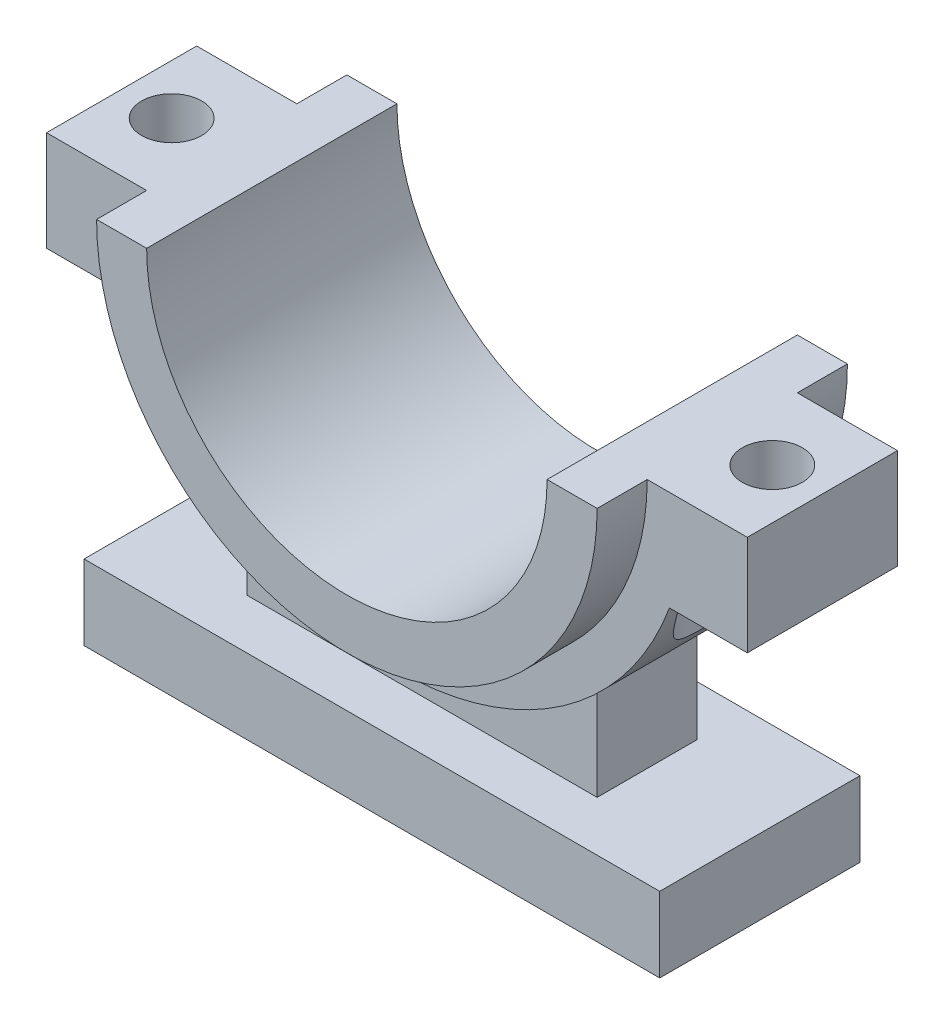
ISO-10303-21;
HEADER;
FILE_DESCRIPTION(('STEP AP214'),'2;1');
FILE_NAME('part.step','',(''),(''),'','','');
FILE_SCHEMA(('AUTOMOTIVE_DESIGN { 1 0 10303 214 1 1 1 1 }'));
ENDSEC;
DATA;
#1=APPLICATION_CONTEXT('core data for automotive mechanical design processes');
#2=APPLICATION_PROTOCOL_DEFINITION('international standard','automotive_design',2000,#1);
#3=PRODUCT_CONTEXT('',#1,'mechanical');
#4=PRODUCT('Part','Part','',(#3));
#5=PRODUCT_RELATED_PRODUCT_CATEGORY('part','',(#4));
#6=PRODUCT_DEFINITION_FORMATION('','',#4);
#7=PRODUCT_DEFINITION_CONTEXT('part definition',#1,'design');
#8=PRODUCT_DEFINITION('design','',#6,#7);
#9=PRODUCT_DEFINITION_SHAPE('','',#8);
#10=(LENGTH_UNIT() NAMED_UNIT(*) SI_UNIT(.MILLI.,.METRE.));
#11=(NAMED_UNIT(*) PLANE_ANGLE_UNIT() SI_UNIT($,.RADIAN.));
#12=(NAMED_UNIT(*) SI_UNIT($,.STERADIAN.) SOLID_ANGLE_UNIT());
#13=UNCERTAINTY_MEASURE_WITH_UNIT(LENGTH_MEASURE(1.E-05),#10,'distance_accuracy_value','');
#14=(GEOMETRIC_REPRESENTATION_CONTEXT(3) GLOBAL_UNCERTAINTY_ASSIGNED_CONTEXT((#13)) GLOBAL_UNIT_ASSIGNED_CONTEXT((#10,
#11,#12)) REPRESENTATION_CONTEXT('',''));
#15=CARTESIAN_POINT('',(0.,0.,0.));
#16=DIRECTION('',(0.,0.,1.));
#17=DIRECTION('',(1.,0.,0.));
#18=AXIS2_PLACEMENT_3D('',#15,#16,#17);
#19=CARTESIAN_POINT('',(0.,0.,15.));
#20=DIRECTION('',(0.,0.,-1.));
#21=DIRECTION('',(-1.,0.,0.));
#22=AXIS2_PLACEMENT_3D('',#19,#20,#21);
#23=CYLINDRICAL_SURFACE('',#22,58.);
#24=DIRECTION('',(0.,0.,-1.));
#25=VECTOR('',#24,1.);
#26=CARTESIAN_POINT('',(-35.,-46.2493243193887,10.));
#27=LINE('',#26,#25);
#28=CARTESIAN_POINT('',(-35.,-46.2493243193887,10.));
#29=VERTEX_POINT('',#28);
#30=CARTESIAN_POINT('',(-35.,-46.2493243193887,-10.));
#31=VERTEX_POINT('',#30);
#32=EDGE_CURVE('E60',#29,#31,#27,.T.);
#33=ORIENTED_EDGE('',*,*,#32,.F.);
#34=CARTESIAN_POINT('',(0.,0.,10.));
#35=DIRECTION('',(0.,0.,1.));
#36=DIRECTION('',(1.,0.,0.));
#37=AXIS2_PLACEMENT_3D('',#34,#35,#36);
#38=CIRCLE('',#37,58.);
#39=CARTESIAN_POINT('',(35.,-46.2493243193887,10.));
#40=VERTEX_POINT('',#39);
#41=EDGE_CURVE('E55',#29,#40,#38,.T.);
#42=ORIENTED_EDGE('',*,*,#41,.T.);
#43=DIRECTION('',(0.,0.,-1.));
#44=VECTOR('',#43,1.);
#45=CARTESIAN_POINT('',(35.,-46.2493243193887,10.));
#46=LINE('',#45,#44);
#47=CARTESIAN_POINT('',(35.,-46.2493243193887,-10.));
#48=VERTEX_POINT('',#47);
#49=EDGE_CURVE('E252',#40,#48,#46,.T.);
#50=ORIENTED_EDGE('',*,*,#49,.T.);
#51=CARTESIAN_POINT('',(0.,0.,-10.));
#52=DIRECTION('',(0.,0.,1.));
#53=DIRECTION('',(1.,0.,0.));
#54=AXIS2_PLACEMENT_3D('',#51,#52,#53);
#55=CIRCLE('',#54,58.);
#56=EDGE_CURVE('E244',#31,#48,#55,.T.);
#57=ORIENTED_EDGE('',*,*,#56,.F.);
#58=EDGE_LOOP('',(#33,#42,#50,#57));
#59=FACE_BOUND('',#58,.T.);
#60=CARTESIAN_POINT('',(-54.4426303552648,-20.,-12.8497331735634));
#61=CARTESIAN_POINT('',(-54.2826467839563,-20.4355339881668,-12.7805017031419));
#62=CARTESIAN_POINT('',(-54.1176847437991,-20.8683993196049,-12.7056478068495));
#63=CARTESIAN_POINT('',(-53.7782681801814,-21.7281186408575,-12.5429569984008));
#64=CARTESIAN_POINT('',(-53.6038099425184,-22.1549701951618,-12.4551149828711));
#65=CARTESIAN_POINT('',(-53.2446160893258,-23.0048999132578,-12.2640294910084));
#66=CARTESIAN_POINT('',(-53.0598117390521,-23.4279237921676,-12.1606727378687));
#67=CARTESIAN_POINT('',(-52.6819381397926,-24.2657061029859,-11.9370927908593));
#68=CARTESIAN_POINT('',(-52.4888698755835,-24.6804655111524,-11.8168716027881));
#69=CARTESIAN_POINT('',(-52.0916321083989,-25.5083647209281,-11.554887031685));
#70=CARTESIAN_POINT('',(-51.8873205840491,-25.9213202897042,-11.4127541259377));
#71=CARTESIAN_POINT('',(-51.4723985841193,-26.7357633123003,-11.1061502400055));
#72=CARTESIAN_POINT('',(-51.2617871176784,-27.1372489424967,-10.9416757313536));
#73=CARTESIAN_POINT('',(-50.836767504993,-27.925307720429,-10.5882628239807));
#74=CARTESIAN_POINT('',(-50.6223743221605,-28.3119260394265,-10.3994076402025));
#75=CARTESIAN_POINT('',(-50.191466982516,-29.0689889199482,-9.99400586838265));
#76=CARTESIAN_POINT('',(-49.9749538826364,-29.439441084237,-9.77747248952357));
#77=CARTESIAN_POINT('',(-49.60349810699,-30.0596830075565,-9.37894550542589));
#78=CARTESIAN_POINT('',(-49.4483569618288,-30.3141178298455,-9.2043536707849));
#79=CARTESIAN_POINT('',(-49.1398326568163,-30.8117266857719,-8.83821754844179));
#80=CARTESIAN_POINT('',(-48.9864497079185,-31.0548993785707,-8.64667125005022));
#81=CARTESIAN_POINT('',(-48.6835324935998,-31.5276427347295,-8.24623571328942));
#82=CARTESIAN_POINT('',(-48.533988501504,-31.7572502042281,-8.03739748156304));
#83=CARTESIAN_POINT('',(-48.2402128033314,-32.2017519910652,-7.6010894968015));
#84=CARTESIAN_POINT('',(-48.0959809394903,-32.416646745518,-7.37362029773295));
#85=CARTESIAN_POINT('',(-47.81318875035,-32.8323469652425,-6.8963449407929));
#86=CARTESIAN_POINT('',(-47.6747285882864,-33.0329286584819,-6.64628328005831));
#87=CARTESIAN_POINT('',(-47.4082039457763,-33.4143131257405,-6.12633387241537));
#88=CARTESIAN_POINT('',(-47.2801369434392,-33.5951207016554,-5.85645096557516));
#89=CARTESIAN_POINT('',(-47.0374049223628,-33.9341418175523,-5.29753237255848));
#90=CARTESIAN_POINT('',(-46.9227258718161,-34.0923790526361,-5.00851724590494));
#91=CARTESIAN_POINT('',(-46.7097275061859,-34.3836289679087,-4.41233649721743));
#92=CARTESIAN_POINT('',(-46.6114011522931,-34.5166525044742,-4.1051787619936));
#93=CARTESIAN_POINT('',(-46.4589952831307,-34.7213647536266,-3.56325142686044));
#94=CARTESIAN_POINT('',(-46.4002381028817,-34.799794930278,-3.33231881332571));
#95=CARTESIAN_POINT('',(-46.293824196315,-34.9412318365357,-2.86330595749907));
#96=CARTESIAN_POINT('',(-46.2461647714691,-35.004242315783,-2.62522746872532));
#97=CARTESIAN_POINT('',(-46.1628881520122,-35.1139931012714,-2.14338233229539));
#98=CARTESIAN_POINT('',(-46.1272657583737,-35.1607404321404,-1.89961818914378));
#99=CARTESIAN_POINT('',(-46.0687740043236,-35.2373437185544,-1.40791792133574));
#100=CARTESIAN_POINT('',(-46.0459050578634,-35.2671991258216,-1.15998166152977));
#101=CARTESIAN_POINT('',(-46.0133746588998,-35.3096314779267,-0.661048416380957));
#102=CARTESIAN_POINT('',(-46.0037512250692,-35.322158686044,-0.410044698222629));
#103=CARTESIAN_POINT('',(-45.9980508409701,-35.3295816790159,0.092377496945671));
#104=CARTESIAN_POINT('',(-46.0019738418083,-35.3244775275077,0.343795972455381));
#105=CARTESIAN_POINT('',(-46.0232779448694,-35.2967164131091,0.845095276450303));
#106=CARTESIAN_POINT('',(-46.0406597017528,-35.2740585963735,1.09497602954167));
#107=CARTESIAN_POINT('',(-46.0884965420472,-35.2115326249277,1.5912980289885));
#108=CARTESIAN_POINT('',(-46.1189515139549,-35.1716646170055,1.83773930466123));
#109=CARTESIAN_POINT('',(-46.1908328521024,-35.077205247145,2.315819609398));
#110=CARTESIAN_POINT('',(-46.2317788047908,-35.0232570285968,2.54765898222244));
#111=CARTESIAN_POINT('',(-46.324359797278,-34.9007103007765,3.00522059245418));
#112=CARTESIAN_POINT('',(-46.3759942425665,-34.8321126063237,3.23094316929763));
#113=CARTESIAN_POINT('',(-46.4890663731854,-34.6810553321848,3.67521818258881));
#114=CARTESIAN_POINT('',(-46.5505061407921,-34.5985928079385,3.89376908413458));
#115=CARTESIAN_POINT('',(-46.6822018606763,-34.4206955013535,4.32280435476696));
#116=CARTESIAN_POINT('',(-46.7524596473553,-34.3252580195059,4.53328703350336));
#117=CARTESIAN_POINT('',(-46.9281261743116,-34.0849018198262,5.02155161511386));
#118=CARTESIAN_POINT('',(-47.0369434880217,-33.9347140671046,5.29552977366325));
#119=CARTESIAN_POINT('',(-47.2665667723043,-33.6141419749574,5.82608949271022));
#120=CARTESIAN_POINT('',(-47.3873763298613,-33.4437515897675,6.0826658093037));
#121=CARTESIAN_POINT('',(-47.6385784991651,-33.0849482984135,6.57818202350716));
#122=CARTESIAN_POINT('',(-47.7689782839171,-32.89652186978,6.81710844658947));
#123=CARTESIAN_POINT('',(-48.0370377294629,-32.5038397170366,7.27725705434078));
#124=CARTESIAN_POINT('',(-48.1746995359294,-32.2995793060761,7.49847395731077));
#125=CARTESIAN_POINT('',(-48.5178925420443,-31.7828306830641,8.01853893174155));
#126=CARTESIAN_POINT('',(-48.7262886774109,-31.4627327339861,8.30795969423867));
#127=CARTESIAN_POINT('',(-49.1489088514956,-30.798376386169,8.85284202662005));
#128=CARTESIAN_POINT('',(-49.3631356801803,-30.4541062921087,9.10828698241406));
#129=CARTESIAN_POINT('',(-49.7944975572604,-29.7435994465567,9.58919281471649));
#130=CARTESIAN_POINT('',(-50.0116421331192,-29.3772518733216,9.81448029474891));
#131=CARTESIAN_POINT('',(-50.4444289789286,-28.6277287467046,10.2363262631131));
#132=CARTESIAN_POINT('',(-50.6600714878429,-28.2445559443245,10.4328894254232));
#133=CARTESIAN_POINT('',(-51.0407332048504,-27.5493119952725,10.7601109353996));
#134=CARTESIAN_POINT('',(-51.2065200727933,-27.2399948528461,10.8957859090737));
#135=CARTESIAN_POINT('',(-51.5348057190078,-26.6136955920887,11.1527551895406));
#136=CARTESIAN_POINT('',(-51.6973041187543,-26.2967126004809,11.2740478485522));
#137=CARTESIAN_POINT('',(-52.0183942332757,-25.6557071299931,11.5036061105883));
#138=CARTESIAN_POINT('',(-52.1769818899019,-25.3316779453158,11.6118585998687));
#139=CARTESIAN_POINT('',(-52.4894812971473,-24.6776360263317,11.8163860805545));
#140=CARTESIAN_POINT('',(-52.6433928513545,-24.3476230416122,11.9126605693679));
#141=CARTESIAN_POINT('',(-52.9430663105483,-23.6888182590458,12.092544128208));
#142=CARTESIAN_POINT('',(-53.0889289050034,-23.3601297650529,12.1763648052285));
#143=CARTESIAN_POINT('',(-53.3753081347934,-22.698161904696,12.3345128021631));
#144=CARTESIAN_POINT('',(-53.5158245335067,-22.3648823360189,12.4088397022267));
#145=CARTESIAN_POINT('',(-53.7908324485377,-21.6950923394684,12.5487051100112));
#146=CARTESIAN_POINT('',(-53.9253388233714,-21.3585926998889,12.6142661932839));
#147=CARTESIAN_POINT('',(-54.1884579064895,-20.6819467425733,12.7376207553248));
#148=CARTESIAN_POINT('',(-54.3170715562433,-20.341801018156,12.7954154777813));
#149=CARTESIAN_POINT('',(-54.4426303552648,-20.,12.8497331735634));
#150=B_SPLINE_CURVE_WITH_KNOTS('',3,(#60,#61,#62,#63,#64,#65,#66,#67,#68,#69,#70,#71,#72,#73,
#74,#75,#76,#77,#78,#79,#80,#81,#82,#83,#84,#85,#86,#87,#88,#89,#90,#91,#92,#93,#94,#95,#96,#97,
#98,#99,#100,#101,#102,#103,#104,#105,#106,#107,#108,#109,#110,#111,#112,#113,#114,#115,#116,
#117,#118,#119,#120,#121,#122,#123,#124,#125,#126,#127,#128,#129,#130,#131,#132,#133,#134,#135,
#136,#137,#138,#139,#140,#141,#142,#143,#144,#145,#146,#147,#148,#149),.UNSPECIFIED.,.F.,.F.,(4,
2,2,2,2,2,2,2,2,2,2,2,2,2,2,2,2,2,2,2,2,2,2,2,2,2,2,2,2,2,2,2,2,2,2,2,2,2,2,2,2,2,2,2,4),(0.,
1.40737975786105,2.81531398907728,4.23407866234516,5.65267473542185,7.0985272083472,
8.54460829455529,9.9858780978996,11.4264626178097,12.4620816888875,13.4978237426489,
14.5306126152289,15.5633707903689,16.609779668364,17.655933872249,18.7009815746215,
19.7455782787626,20.4974312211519,21.2491011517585,22.0004460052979,22.7518152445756,
23.5053366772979,24.2588553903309,25.0124107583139,25.7659596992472,26.4897701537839,
27.213540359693,27.9374644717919,28.66153943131,29.6526139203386,30.6439857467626,
31.6361067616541,32.6285225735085,34.0639471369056,35.5000710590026,36.944126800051,
38.3879473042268,39.5163502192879,40.6448822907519,41.7745399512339,42.904244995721,
44.0117633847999,45.1193307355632,46.223988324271,47.3284688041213),.UNSPECIFIED.);
#151=CARTESIAN_POINT('',(-54.4426303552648,-20.,-12.8497331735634));
#152=VERTEX_POINT('',#151);
#153=CARTESIAN_POINT('',(-54.4426303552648,-20.,12.8497331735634));
#154=VERTEX_POINT('',#153);
#155=EDGE_CURVE('E11',#152,#154,#150,.T.);
#156=ORIENTED_EDGE('',*,*,#155,.F.);
#157=DIRECTION('',(0.,0.,-1.));
#158=VECTOR('',#157,1.);
#159=CARTESIAN_POINT('',(-54.4426303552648,-20.,15.));
#160=LINE('',#159,#158);
#161=CARTESIAN_POINT('',(-54.4426303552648,-20.,-15.));
#162=VERTEX_POINT('',#161);
#163=EDGE_CURVE('E343',#152,#162,#160,.T.);
#164=ORIENTED_EDGE('',*,*,#163,.T.);
#165=CARTESIAN_POINT('',(0.,0.,-15.));
#166=DIRECTION('',(0.,0.,1.));
#167=DIRECTION('',(1.,0.,0.));
#168=AXIS2_PLACEMENT_3D('',#165,#166,#167);
#169=CIRCLE('',#168,58.);
#170=CARTESIAN_POINT('',(54.4426303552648,-20.,-15.));
#171=VERTEX_POINT('',#170);
#172=EDGE_CURVE('E376',#162,#171,#169,.T.);
#173=ORIENTED_EDGE('',*,*,#172,.T.);
#174=DIRECTION('',(0.,0.,-1.));
#175=VECTOR('',#174,1.);
#176=CARTESIAN_POINT('',(54.4426303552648,-20.,15.));
#177=LINE('',#176,#175);
#178=CARTESIAN_POINT('',(54.4426303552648,-20.,-12.8497331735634));
#179=VERTEX_POINT('',#178);
#180=EDGE_CURVE('E357',#179,#171,#177,.T.);
#181=ORIENTED_EDGE('',*,*,#180,.F.);
#182=CARTESIAN_POINT('',(54.4426303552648,-20.,12.8497331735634));
#183=CARTESIAN_POINT('',(54.2826467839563,-20.4355339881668,12.7805017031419));
#184=CARTESIAN_POINT('',(54.1176847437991,-20.8683993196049,12.7056478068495));
#185=CARTESIAN_POINT('',(53.7782681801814,-21.7281186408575,12.5429569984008));
#186=CARTESIAN_POINT('',(53.6038099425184,-22.1549701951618,12.4551149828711));
#187=CARTESIAN_POINT('',(53.2446160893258,-23.0048999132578,12.2640294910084));
#188=CARTESIAN_POINT('',(53.0598117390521,-23.4279237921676,12.1606727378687));
#189=CARTESIAN_POINT('',(52.6819381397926,-24.2657061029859,11.9370927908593));
#190=CARTESIAN_POINT('',(52.4888698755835,-24.6804655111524,11.8168716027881));
#191=CARTESIAN_POINT('',(52.0916321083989,-25.5083647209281,11.554887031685));
#192=CARTESIAN_POINT('',(51.8873205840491,-25.9213202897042,11.4127541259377));
#193=CARTESIAN_POINT('',(51.4723985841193,-26.7357633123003,11.1061502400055));
#194=CARTESIAN_POINT('',(51.2617871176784,-27.1372489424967,10.9416757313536));
#195=CARTESIAN_POINT('',(50.836767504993,-27.9253077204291,10.5882628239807));
#196=CARTESIAN_POINT('',(50.6223743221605,-28.3119260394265,10.3994076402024));
#197=CARTESIAN_POINT('',(50.191466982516,-29.0689889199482,9.99400586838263));
#198=CARTESIAN_POINT('',(49.9749538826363,-29.439441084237,9.77747248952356));
#199=CARTESIAN_POINT('',(49.60349810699,-30.0596830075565,9.37894550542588));
#200=CARTESIAN_POINT('',(49.4483569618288,-30.3141178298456,9.20435367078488));
#201=CARTESIAN_POINT('',(49.1398326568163,-30.8117266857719,8.83821754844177));
#202=CARTESIAN_POINT('',(48.9864497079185,-31.0548993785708,8.6466712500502));
#203=CARTESIAN_POINT('',(48.6835324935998,-31.5276427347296,8.2462357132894));
#204=CARTESIAN_POINT('',(48.533988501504,-31.7572502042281,8.03739748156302));
#205=CARTESIAN_POINT('',(48.2402128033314,-32.2017519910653,7.60108949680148));
#206=CARTESIAN_POINT('',(48.0959809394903,-32.416646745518,7.37362029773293));
#207=CARTESIAN_POINT('',(47.81318875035,-32.8323469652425,6.89634494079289));
#208=CARTESIAN_POINT('',(47.6747285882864,-33.0329286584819,6.64628328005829));
#209=CARTESIAN_POINT('',(47.4082039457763,-33.4143131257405,6.12633387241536));
#210=CARTESIAN_POINT('',(47.2801369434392,-33.5951207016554,5.85645096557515));
#211=CARTESIAN_POINT('',(47.0374049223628,-33.9341418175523,5.29753237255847));
#212=CARTESIAN_POINT('',(46.9227258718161,-34.0923790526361,5.00851724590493));
#213=CARTESIAN_POINT('',(46.7097275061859,-34.3836289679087,4.41233649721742));
#214=CARTESIAN_POINT('',(46.6114011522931,-34.5166525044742,4.10517876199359));
#215=CARTESIAN_POINT('',(46.4589952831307,-34.7213647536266,3.56325142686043));
#216=CARTESIAN_POINT('',(46.4002381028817,-34.799794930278,3.3323188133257));
#217=CARTESIAN_POINT('',(46.293824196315,-34.9412318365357,2.86330595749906));
#218=CARTESIAN_POINT('',(46.2461647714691,-35.004242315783,2.62522746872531));
#219=CARTESIAN_POINT('',(46.1628881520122,-35.1139931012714,2.14338233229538));
#220=CARTESIAN_POINT('',(46.1272657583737,-35.1607404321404,1.89961818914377));
#221=CARTESIAN_POINT('',(46.0687740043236,-35.2373437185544,1.40791792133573));
#222=CARTESIAN_POINT('',(46.0459050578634,-35.2671991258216,1.15998166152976));
#223=CARTESIAN_POINT('',(46.0133746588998,-35.3096314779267,0.661048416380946));
#224=CARTESIAN_POINT('',(46.0037512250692,-35.3221586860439,0.410044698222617));
#225=CARTESIAN_POINT('',(45.9980508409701,-35.3295816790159,-0.092377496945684));
#226=CARTESIAN_POINT('',(46.0019738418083,-35.3244775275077,-0.343795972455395));
#227=CARTESIAN_POINT('',(46.0232779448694,-35.2967164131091,-0.845095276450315));
#228=CARTESIAN_POINT('',(46.0406597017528,-35.2740585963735,-1.09497602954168));
#229=CARTESIAN_POINT('',(46.0884965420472,-35.2115326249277,-1.59129802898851));
#230=CARTESIAN_POINT('',(46.1189515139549,-35.1716646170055,-1.83773930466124));
#231=CARTESIAN_POINT('',(46.1908328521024,-35.077205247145,-2.31581960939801));
#232=CARTESIAN_POINT('',(46.2317788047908,-35.0232570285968,-2.54765898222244));
#233=CARTESIAN_POINT('',(46.324359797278,-34.9007103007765,-3.00522059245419));
#234=CARTESIAN_POINT('',(46.3759942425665,-34.8321126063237,-3.23094316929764));
#235=CARTESIAN_POINT('',(46.4890663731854,-34.6810553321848,-3.67521818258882));
#236=CARTESIAN_POINT('',(46.5505061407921,-34.5985928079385,-3.89376908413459));
#237=CARTESIAN_POINT('',(46.6822018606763,-34.4206955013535,-4.32280435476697));
#238=CARTESIAN_POINT('',(46.7524596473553,-34.3252580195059,-4.53328703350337));
#239=CARTESIAN_POINT('',(46.9281261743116,-34.0849018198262,-5.02155161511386));
#240=CARTESIAN_POINT('',(47.0369434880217,-33.9347140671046,-5.29552977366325));
#241=CARTESIAN_POINT('',(47.2665667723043,-33.6141419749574,-5.82608949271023));
#242=CARTESIAN_POINT('',(47.3873763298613,-33.4437515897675,-6.08266580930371));
#243=CARTESIAN_POINT('',(47.6385784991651,-33.0849482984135,-6.57818202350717));
#244=CARTESIAN_POINT('',(47.7689782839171,-32.89652186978,-6.81710844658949));
#245=CARTESIAN_POINT('',(48.0370377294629,-32.5038397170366,-7.27725705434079));
#246=CARTESIAN_POINT('',(48.1746995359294,-32.2995793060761,-7.49847395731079));
#247=CARTESIAN_POINT('',(48.5178925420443,-31.782830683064,-8.01853893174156));
#248=CARTESIAN_POINT('',(48.7262886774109,-31.4627327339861,-8.30795969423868));
#249=CARTESIAN_POINT('',(49.1489088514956,-30.798376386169,-8.85284202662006));
#250=CARTESIAN_POINT('',(49.3631356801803,-30.4541062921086,-9.10828698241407));
#251=CARTESIAN_POINT('',(49.7944975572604,-29.7435994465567,-9.58919281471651));
#252=CARTESIAN_POINT('',(50.0116421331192,-29.3772518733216,-9.81448029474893));
#253=CARTESIAN_POINT('',(50.4444289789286,-28.6277287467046,-10.2363262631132));
#254=CARTESIAN_POINT('',(50.6600714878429,-28.2445559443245,-10.4328894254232));
#255=CARTESIAN_POINT('',(51.0407332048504,-27.5493119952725,-10.7601109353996));
#256=CARTESIAN_POINT('',(51.2065200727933,-27.2399948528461,-10.8957859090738));
#257=CARTESIAN_POINT('',(51.5348057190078,-26.6136955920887,-11.1527551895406));
#258=CARTESIAN_POINT('',(51.6973041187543,-26.2967126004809,-11.2740478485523));
#259=CARTESIAN_POINT('',(52.0183942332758,-25.6557071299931,-11.5036061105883));
#260=CARTESIAN_POINT('',(52.1769818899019,-25.3316779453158,-11.6118585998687));
#261=CARTESIAN_POINT('',(52.4894812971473,-24.6776360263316,-11.8163860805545));
#262=CARTESIAN_POINT('',(52.6433928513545,-24.3476230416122,-11.912660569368));
#263=CARTESIAN_POINT('',(52.9430663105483,-23.6888182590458,-12.092544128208));
#264=CARTESIAN_POINT('',(53.0889289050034,-23.3601297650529,-12.1763648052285));
#265=CARTESIAN_POINT('',(53.3753081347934,-22.698161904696,-12.3345128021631));
#266=CARTESIAN_POINT('',(53.5158245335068,-22.3648823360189,-12.4088397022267));
#267=CARTESIAN_POINT('',(53.7908324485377,-21.6950923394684,-12.5487051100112));
#268=CARTESIAN_POINT('',(53.9253388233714,-21.3585926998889,-12.6142661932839));
#269=CARTESIAN_POINT('',(54.1884579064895,-20.6819467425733,-12.7376207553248));
#270=CARTESIAN_POINT('',(54.3170715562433,-20.341801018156,-12.7954154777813));
#271=CARTESIAN_POINT('',(54.4426303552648,-20.,-12.8497331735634));
#272=B_SPLINE_CURVE_WITH_KNOTS('',3,(#182,#183,#184,#185,#186,#187,#188,#189,#190,#191,#192,
#193,#194,#195,#196,#197,#198,#199,#200,#201,#202,#203,#204,#205,#206,#207,#208,#209,#210,#211,
#212,#213,#214,#215,#216,#217,#218,#219,#220,#221,#222,#223,#224,#225,#226,#227,#228,#229,#230,
#231,#232,#233,#234,#235,#236,#237,#238,#239,#240,#241,#242,#243,#244,#245,#246,#247,#248,#249,
#250,#251,#252,#253,#254,#255,#256,#257,#258,#259,#260,#261,#262,#263,#264,#265,#266,#267,#268,
#269,#270,#271),.UNSPECIFIED.,.F.,.F.,(4,2,2,2,2,2,2,2,2,2,2,2,2,2,2,2,2,2,2,2,2,2,2,2,2,2,2,2,
2,2,2,2,2,2,2,2,2,2,2,2,2,2,2,2,4),(0.,1.40737975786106,2.81531398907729,4.23407866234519,
5.65267473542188,7.09852720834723,8.54460829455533,9.98587809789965,11.4264626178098,
12.4620816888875,13.4978237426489,14.5306126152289,15.5633707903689,16.609779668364,
17.655933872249,18.7009815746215,19.7455782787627,20.4974312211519,21.2491011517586,
22.0004460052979,22.7518152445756,23.5053366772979,24.2588553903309,25.0124107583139,
25.7659596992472,26.4897701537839,27.213540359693,27.937464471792,28.66153943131,
29.6526139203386,30.6439857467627,31.6361067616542,32.6285225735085,34.0639471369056,
35.5000710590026,36.944126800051,38.3879473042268,39.5163502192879,40.6448822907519,
41.7745399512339,42.904244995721,44.0117633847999,45.1193307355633,46.223988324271,
47.3284688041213),.UNSPECIFIED.);
#273=CARTESIAN_POINT('',(54.4426303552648,-20.,12.8497331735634));
#274=VERTEX_POINT('',#273);
#275=EDGE_CURVE('E260',#274,#179,#272,.T.);
#276=ORIENTED_EDGE('',*,*,#275,.F.);
#277=CARTESIAN_POINT('',(54.4426303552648,-20.,15.));
#278=VERTEX_POINT('',#277);
#279=EDGE_CURVE('E353',#278,#274,#177,.T.);
#280=ORIENTED_EDGE('',*,*,#279,.F.);
#281=CARTESIAN_POINT('',(0.,0.,15.));
#282=DIRECTION('',(0.,0.,1.));
#283=DIRECTION('',(1.,0.,0.));
#284=AXIS2_PLACEMENT_3D('',#281,#282,#283);
#285=CIRCLE('',#284,58.);
#286=CARTESIAN_POINT('',(-54.4426303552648,-20.,15.));
#287=VERTEX_POINT('',#286);
#288=EDGE_CURVE('E431',#287,#278,#285,.T.);
#289=ORIENTED_EDGE('',*,*,#288,.F.);
#290=EDGE_CURVE('E347',#287,#154,#160,.T.);
#291=ORIENTED_EDGE('',*,*,#290,.T.);
#292=EDGE_LOOP('',(#156,#164,#173,#181,#276,#280,#289,#291));
#293=FACE_BOUND('',#292,.T.);
#294=ADVANCED_FACE('F35',(#59,#293),#23,.T.);
#295=CARTESIAN_POINT('',(0.,0.,15.));
#296=DIRECTION('',(0.,-1.,0.));
#297=DIRECTION('',(1.,0.,0.));
#298=AXIS2_PLACEMENT_3D('',#295,#296,#297);
#299=PLANE('',#298);
#300=CARTESIAN_POINT('',(-60.,0.,0.));
#301=DIRECTION('',(0.,-1.,0.));
#302=DIRECTION('',(0.,0.,-1.));
#303=AXIS2_PLACEMENT_3D('',#300,#301,#302);
#304=CIRCLE('',#303,6.);
#305=CARTESIAN_POINT('',(-60.,0.,-6.));
#306=VERTEX_POINT('',#305);
#307=EDGE_CURVE('E269',#306,#306,#304,.T.);
#308=ORIENTED_EDGE('',*,*,#307,.T.);
#309=EDGE_LOOP('',(#308));
#310=FACE_BOUND('',#309,.T.);
#311=DIRECTION('',(-1.,0.,0.));
#312=VECTOR('',#311,1.);
#313=CARTESIAN_POINT('',(0.,0.,-15.));
#314=LINE('',#313,#312);
#315=CARTESIAN_POINT('',(-50.,0.,-15.));
#316=VERTEX_POINT('',#315);
#317=CARTESIAN_POINT('',(-70.,0.,-15.));
#318=VERTEX_POINT('',#317);
#319=EDGE_CURVE('E374',#316,#318,#314,.T.);
#320=ORIENTED_EDGE('',*,*,#319,.T.);
#321=DIRECTION('',(0.,0.,-1.));
#322=VECTOR('',#321,1.);
#323=CARTESIAN_POINT('',(-70.,0.,15.));
#324=LINE('',#323,#322);
#325=CARTESIAN_POINT('',(-70.,0.,15.));
#326=VERTEX_POINT('',#325);
#327=EDGE_CURVE('E48',#326,#318,#324,.T.);
#328=ORIENTED_EDGE('',*,*,#327,.F.);
#329=DIRECTION('',(-1.,0.,0.));
#330=VECTOR('',#329,1.);
#331=CARTESIAN_POINT('',(0.,0.,15.));
#332=LINE('',#331,#330);
#333=CARTESIAN_POINT('',(-50.,0.,15.));
#334=VERTEX_POINT('',#333);
#335=EDGE_CURVE('E426',#334,#326,#332,.T.);
#336=ORIENTED_EDGE('',*,*,#335,.F.);
#337=DIRECTION('',(0.,0.,-1.));
#338=VECTOR('',#337,1.);
#339=CARTESIAN_POINT('',(-50.,0.,25.));
#340=LINE('',#339,#338);
#341=CARTESIAN_POINT('',(-50.,0.,25.));
#342=VERTEX_POINT('',#341);
#343=EDGE_CURVE('E418',#342,#334,#340,.T.);
#344=ORIENTED_EDGE('',*,*,#343,.F.);
#345=DIRECTION('',(-1.,0.,0.));
#346=VECTOR('',#345,1.);
#347=CARTESIAN_POINT('',(0.,0.,25.));
#348=LINE('',#347,#346);
#349=CARTESIAN_POINT('',(-40.,0.,25.));
#350=VERTEX_POINT('',#349);
#351=EDGE_CURVE('E436',#350,#342,#348,.T.);
#352=ORIENTED_EDGE('',*,*,#351,.F.);
#353=DIRECTION('',(0.,0.,-1.));
#354=VECTOR('',#353,1.);
#355=CARTESIAN_POINT('',(-40.,0.,25.));
#356=LINE('',#355,#354);
#357=CARTESIAN_POINT('',(-40.,0.,-25.));
#358=VERTEX_POINT('',#357);
#359=EDGE_CURVE('E439',#350,#358,#356,.T.);
#360=ORIENTED_EDGE('',*,*,#359,.T.);
#361=DIRECTION('',(-1.,0.,0.));
#362=VECTOR('',#361,1.);
#363=CARTESIAN_POINT('',(0.,0.,-25.));
#364=LINE('',#363,#362);
#365=CARTESIAN_POINT('',(-50.,0.,-25.));
#366=VERTEX_POINT('',#365);
#367=EDGE_CURVE('E454',#358,#366,#364,.T.);
#368=ORIENTED_EDGE('',*,*,#367,.T.);
#369=EDGE_CURVE('E419',#316,#366,#340,.T.);
#370=ORIENTED_EDGE('',*,*,#369,.F.);
#371=EDGE_LOOP('',(#320,#328,#336,#344,#352,#360,#368,#370));
#372=FACE_BOUND('',#371,.T.);
#373=ADVANCED_FACE('F37',(#310,#372),#299,.F.);
#374=CARTESIAN_POINT('',(-70.,0.,15.));
#375=DIRECTION('',(1.,0.,0.));
#376=DIRECTION('',(0.,0.,-1.));
#377=AXIS2_PLACEMENT_3D('',#374,#375,#376);
#378=PLANE('',#377);
#379=DIRECTION('',(0.,-1.,0.));
#380=VECTOR('',#379,1.);
#381=CARTESIAN_POINT('',(-70.,0.,-15.));
#382=LINE('',#381,#380);
#383=CARTESIAN_POINT('',(-70.,-20.,-15.));
#384=VERTEX_POINT('',#383);
#385=EDGE_CURVE('E368',#318,#384,#382,.T.);
#386=ORIENTED_EDGE('',*,*,#385,.T.);
#387=DIRECTION('',(0.,0.,-1.));
#388=VECTOR('',#387,1.);
#389=CARTESIAN_POINT('',(-70.,-20.,15.));
#390=LINE('',#389,#388);
#391=CARTESIAN_POINT('',(-70.,-20.,15.));
#392=VERTEX_POINT('',#391);
#393=EDGE_CURVE('E355',#392,#384,#390,.T.);
#394=ORIENTED_EDGE('',*,*,#393,.F.);
#395=DIRECTION('',(0.,-1.,0.));
#396=VECTOR('',#395,1.);
#397=CARTESIAN_POINT('',(-70.,0.,15.));
#398=LINE('',#397,#396);
#399=EDGE_CURVE('E369',#326,#392,#398,.T.);
#400=ORIENTED_EDGE('',*,*,#399,.F.);
#401=ORIENTED_EDGE('',*,*,#327,.T.);
#402=EDGE_LOOP('',(#386,#394,#400,#401));
#403=FACE_BOUND('',#402,.T.);
#404=ADVANCED_FACE('F330',(#403),#378,.F.);
#405=CARTESIAN_POINT('',(0.,-20.,15.));
#406=DIRECTION('',(0.,1.,0.));
#407=DIRECTION('',(0.,0.,1.));
#408=AXIS2_PLACEMENT_3D('',#405,#406,#407);
#409=PLANE('',#408);
#410=ORIENTED_EDGE('',*,*,#393,.T.);
#411=DIRECTION('',(1.,0.,0.));
#412=VECTOR('',#411,1.);
#413=CARTESIAN_POINT('',(0.,-20.,-15.));
#414=LINE('',#413,#412);
#415=EDGE_CURVE('E351',#384,#162,#414,.T.);
#416=ORIENTED_EDGE('',*,*,#415,.T.);
#417=ORIENTED_EDGE('',*,*,#163,.F.);
#418=CARTESIAN_POINT('',(-60.,-20.,0.));
#419=DIRECTION('',(0.,-1.,0.));
#420=DIRECTION('',(0.,0.,-1.));
#421=AXIS2_PLACEMENT_3D('',#418,#419,#420);
#422=CIRCLE('',#421,14.);
#423=EDGE_CURVE('E257',#152,#154,#422,.T.);
#424=ORIENTED_EDGE('',*,*,#423,.T.);
#425=ORIENTED_EDGE('',*,*,#290,.F.);
#426=DIRECTION('',(1.,0.,0.));
#427=VECTOR('',#426,1.);
#428=CARTESIAN_POINT('',(0.,-20.,15.));
#429=LINE('',#428,#427);
#430=EDGE_CURVE('E429',#392,#287,#429,.T.);
#431=ORIENTED_EDGE('',*,*,#430,.F.);
#432=EDGE_LOOP('',(#410,#416,#417,#424,#425,#431));
#433=FACE_BOUND('',#432,.T.);
#434=CARTESIAN_POINT('',(-60.,-20.,0.));
#435=DIRECTION('',(0.,-1.,0.));
#436=DIRECTION('',(0.,0.,-1.));
#437=AXIS2_PLACEMENT_3D('',#434,#435,#436);
#438=CIRCLE('',#437,6.);
#439=CARTESIAN_POINT('',(-60.,-20.,-6.));
#440=VERTEX_POINT('',#439);
#441=EDGE_CURVE('E697',#440,#440,#438,.T.);
#442=ORIENTED_EDGE('',*,*,#441,.F.);
#443=EDGE_LOOP('',(#442));
#444=FACE_BOUND('',#443,.T.);
#445=ADVANCED_FACE('F325',(#433,#444),#409,.F.);
#446=CARTESIAN_POINT('',(0.,-20.,15.));
#447=DIRECTION('',(0.,-1.,0.));
#448=DIRECTION('',(0.,0.,-1.));
#449=AXIS2_PLACEMENT_3D('',#446,#447,#448);
#450=PLANE('',#449);
#451=CARTESIAN_POINT('',(60.,-20.,0.));
#452=DIRECTION('',(0.,-1.,0.));
#453=DIRECTION('',(0.,0.,-1.));
#454=AXIS2_PLACEMENT_3D('',#451,#452,#453);
#455=CIRCLE('',#454,14.);
#456=EDGE_CURVE('E256',#274,#179,#455,.T.);
#457=ORIENTED_EDGE('',*,*,#456,.T.);
#458=ORIENTED_EDGE('',*,*,#180,.T.);
#459=DIRECTION('',(-1.,0.,0.));
#460=VECTOR('',#459,1.);
#461=CARTESIAN_POINT('',(0.,-20.,-15.));
#462=LINE('',#461,#460);
#463=CARTESIAN_POINT('',(70.,-20.,-15.));
#464=VERTEX_POINT('',#463);
#465=EDGE_CURVE('E383',#464,#171,#462,.T.);
#466=ORIENTED_EDGE('',*,*,#465,.F.);
#467=DIRECTION('',(0.,0.,-1.));
#468=VECTOR('',#467,1.);
#469=CARTESIAN_POINT('',(70.,-20.,15.));
#470=LINE('',#469,#468);
#471=CARTESIAN_POINT('',(70.,-20.,15.));
#472=VERTEX_POINT('',#471);
#473=EDGE_CURVE('E394',#472,#464,#470,.T.);
#474=ORIENTED_EDGE('',*,*,#473,.F.);
#475=DIRECTION('',(-1.,0.,0.));
#476=VECTOR('',#475,1.);
#477=CARTESIAN_POINT('',(0.,-20.,15.));
#478=LINE('',#477,#476);
#479=EDGE_CURVE('E410',#472,#278,#478,.T.);
#480=ORIENTED_EDGE('',*,*,#479,.T.);
#481=ORIENTED_EDGE('',*,*,#279,.T.);
#482=EDGE_LOOP('',(#457,#458,#466,#474,#480,#481));
#483=FACE_BOUND('',#482,.T.);
#484=CARTESIAN_POINT('',(60.,-20.,0.));
#485=DIRECTION('',(0.,-1.,0.));
#486=DIRECTION('',(0.,0.,-1.));
#487=AXIS2_PLACEMENT_3D('',#484,#485,#486);
#488=CIRCLE('',#487,6.);
#489=CARTESIAN_POINT('',(60.,-20.,-6.));
#490=VERTEX_POINT('',#489);
#491=EDGE_CURVE('E700',#490,#490,#488,.T.);
#492=ORIENTED_EDGE('',*,*,#491,.F.);
#493=EDGE_LOOP('',(#492));
#494=FACE_BOUND('',#493,.T.);
#495=ADVANCED_FACE('F322',(#483,#494),#450,.T.);
#496=CARTESIAN_POINT('',(70.,0.,15.));
#497=DIRECTION('',(1.,0.,0.));
#498=DIRECTION('',(0.,0.,-1.));
#499=AXIS2_PLACEMENT_3D('',#496,#497,#498);
#500=PLANE('',#499);
#501=DIRECTION('',(0.,-1.,0.));
#502=VECTOR('',#501,1.);
#503=CARTESIAN_POINT('',(70.,0.,-15.));
#504=LINE('',#503,#502);
#505=CARTESIAN_POINT('',(70.,0.,-15.));
#506=VERTEX_POINT('',#505);
#507=EDGE_CURVE('E386',#506,#464,#504,.T.);
#508=ORIENTED_EDGE('',*,*,#507,.F.);
#509=DIRECTION('',(0.,0.,-1.));
#510=VECTOR('',#509,1.);
#511=CARTESIAN_POINT('',(70.,0.,15.));
#512=LINE('',#511,#510);
#513=CARTESIAN_POINT('',(70.,0.,15.));
#514=VERTEX_POINT('',#513);
#515=EDGE_CURVE('E393',#514,#506,#512,.T.);
#516=ORIENTED_EDGE('',*,*,#515,.F.);
#517=DIRECTION('',(0.,-1.,0.));
#518=VECTOR('',#517,1.);
#519=CARTESIAN_POINT('',(70.,0.,15.));
#520=LINE('',#519,#518);
#521=EDGE_CURVE('E403',#514,#472,#520,.T.);
#522=ORIENTED_EDGE('',*,*,#521,.T.);
#523=ORIENTED_EDGE('',*,*,#473,.T.);
#524=EDGE_LOOP('',(#508,#516,#522,#523));
#525=FACE_BOUND('',#524,.T.);
#526=ADVANCED_FACE('F319',(#525),#500,.T.);
#527=CARTESIAN_POINT('',(0.,0.,15.));
#528=DIRECTION('',(0.,1.,0.));
#529=DIRECTION('',(-1.,0.,0.));
#530=AXIS2_PLACEMENT_3D('',#527,#528,#529);
#531=PLANE('',#530);
#532=CARTESIAN_POINT('',(60.,0.,0.));
#533=DIRECTION('',(0.,-1.,0.));
#534=DIRECTION('',(0.,0.,-1.));
#535=AXIS2_PLACEMENT_3D('',#532,#533,#534);
#536=CIRCLE('',#535,6.);
#537=CARTESIAN_POINT('',(60.,0.,-6.));
#538=VERTEX_POINT('',#537);
#539=EDGE_CURVE('E268',#538,#538,#536,.T.);
#540=ORIENTED_EDGE('',*,*,#539,.T.);
#541=EDGE_LOOP('',(#540));
#542=FACE_BOUND('',#541,.T.);
#543=DIRECTION('',(1.,0.,0.));
#544=VECTOR('',#543,1.);
#545=CARTESIAN_POINT('',(0.,0.,-15.));
#546=LINE('',#545,#544);
#547=CARTESIAN_POINT('',(50.,0.,-15.));
#548=VERTEX_POINT('',#547);
#549=EDGE_CURVE('E389',#548,#506,#546,.T.);
#550=ORIENTED_EDGE('',*,*,#549,.F.);
#551=DIRECTION('',(0.,0.,-1.));
#552=VECTOR('',#551,1.);
#553=CARTESIAN_POINT('',(50.,0.,25.));
#554=LINE('',#553,#552);
#555=CARTESIAN_POINT('',(50.,0.,-25.));
#556=VERTEX_POINT('',#555);
#557=EDGE_CURVE('E463',#548,#556,#554,.T.);
#558=ORIENTED_EDGE('',*,*,#557,.T.);
#559=DIRECTION('',(1.,0.,0.));
#560=VECTOR('',#559,1.);
#561=CARTESIAN_POINT('',(0.,0.,-25.));
#562=LINE('',#561,#560);
#563=CARTESIAN_POINT('',(40.,0.,-25.));
#564=VERTEX_POINT('',#563);
#565=EDGE_CURVE('E459',#564,#556,#562,.T.);
#566=ORIENTED_EDGE('',*,*,#565,.F.);
#567=DIRECTION('',(0.,0.,-1.));
#568=VECTOR('',#567,1.);
#569=CARTESIAN_POINT('',(40.,0.,25.));
#570=LINE('',#569,#568);
#571=CARTESIAN_POINT('',(40.,0.,25.));
#572=VERTEX_POINT('',#571);
#573=EDGE_CURVE('E449',#572,#564,#570,.T.);
#574=ORIENTED_EDGE('',*,*,#573,.F.);
#575=DIRECTION('',(1.,0.,0.));
#576=VECTOR('',#575,1.);
#577=CARTESIAN_POINT('',(0.,0.,25.));
#578=LINE('',#577,#576);
#579=CARTESIAN_POINT('',(50.,0.,25.));
#580=VERTEX_POINT('',#579);
#581=EDGE_CURVE('E447',#572,#580,#578,.T.);
#582=ORIENTED_EDGE('',*,*,#581,.T.);
#583=CARTESIAN_POINT('',(50.,0.,15.));
#584=VERTEX_POINT('',#583);
#585=EDGE_CURVE('E415',#580,#584,#554,.T.);
#586=ORIENTED_EDGE('',*,*,#585,.T.);
#587=DIRECTION('',(1.,0.,0.));
#588=VECTOR('',#587,1.);
#589=CARTESIAN_POINT('',(0.,0.,15.));
#590=LINE('',#589,#588);
#591=EDGE_CURVE('E395',#584,#514,#590,.T.);
#592=ORIENTED_EDGE('',*,*,#591,.T.);
#593=ORIENTED_EDGE('',*,*,#515,.T.);
#594=EDGE_LOOP('',(#550,#558,#566,#574,#582,#586,#592,#593));
#595=FACE_BOUND('',#594,.T.);
#596=ADVANCED_FACE('F312',(#542,#595),#531,.T.);
#597=CARTESIAN_POINT('',(0.,0.,15.));
#598=DIRECTION('',(0.,0.,1.));
#599=DIRECTION('',(1.,0.,0.));
#600=AXIS2_PLACEMENT_3D('',#597,#598,#599);
#601=PLANE('',#600);
#602=CARTESIAN_POINT('',(0.,0.,15.));
#603=DIRECTION('',(0.,0.,1.));
#604=DIRECTION('',(1.,0.,0.));
#605=AXIS2_PLACEMENT_3D('',#602,#603,#604);
#606=CIRCLE('',#605,50.);
#607=EDGE_CURVE('E392',#334,#584,#606,.T.);
#608=ORIENTED_EDGE('',*,*,#607,.F.);
#609=ORIENTED_EDGE('',*,*,#335,.T.);
#610=ORIENTED_EDGE('',*,*,#399,.T.);
#611=ORIENTED_EDGE('',*,*,#430,.T.);
#612=ORIENTED_EDGE('',*,*,#288,.T.);
#613=ORIENTED_EDGE('',*,*,#479,.F.);
#614=ORIENTED_EDGE('',*,*,#521,.F.);
#615=ORIENTED_EDGE('',*,*,#591,.F.);
#616=EDGE_LOOP('',(#608,#609,#610,#611,#612,#613,#614,#615));
#617=FACE_BOUND('',#616,.T.);
#618=ADVANCED_FACE('F308',(#617),#601,.T.);
#619=CARTESIAN_POINT('',(0.,0.,-15.));
#620=DIRECTION('',(0.,0.,1.));
#621=DIRECTION('',(1.,0.,0.));
#622=AXIS2_PLACEMENT_3D('',#619,#620,#621);
#623=PLANE('',#622);
#624=CARTESIAN_POINT('',(0.,0.,-15.));
#625=DIRECTION('',(0.,0.,1.));
#626=DIRECTION('',(1.,0.,0.));
#627=AXIS2_PLACEMENT_3D('',#624,#625,#626);
#628=CIRCLE('',#627,50.);
#629=EDGE_CURVE('E378',#316,#548,#628,.T.);
#630=ORIENTED_EDGE('',*,*,#629,.T.);
#631=ORIENTED_EDGE('',*,*,#549,.T.);
#632=ORIENTED_EDGE('',*,*,#507,.T.);
#633=ORIENTED_EDGE('',*,*,#465,.T.);
#634=ORIENTED_EDGE('',*,*,#172,.F.);
#635=ORIENTED_EDGE('',*,*,#415,.F.);
#636=ORIENTED_EDGE('',*,*,#385,.F.);
#637=ORIENTED_EDGE('',*,*,#319,.F.);
#638=EDGE_LOOP('',(#630,#631,#632,#633,#634,#635,#636,#637));
#639=FACE_BOUND('',#638,.T.);
#640=ADVANCED_FACE('F311',(#639),#623,.F.);
#641=CARTESIAN_POINT('',(0.,0.,25.));
#642=DIRECTION('',(0.,0.,-1.));
#643=DIRECTION('',(-1.,0.,0.));
#644=AXIS2_PLACEMENT_3D('',#641,#642,#643);
#645=CYLINDRICAL_SURFACE('',#644,50.);
#646=ORIENTED_EDGE('',*,*,#557,.F.);
#647=ORIENTED_EDGE('',*,*,#629,.F.);
#648=ORIENTED_EDGE('',*,*,#369,.T.);
#649=CARTESIAN_POINT('',(0.,0.,-25.));
#650=DIRECTION('',(0.,0.,1.));
#651=DIRECTION('',(1.,0.,0.));
#652=AXIS2_PLACEMENT_3D('',#649,#650,#651);
#653=CIRCLE('',#652,50.);
#654=EDGE_CURVE('E456',#366,#556,#653,.T.);
#655=ORIENTED_EDGE('',*,*,#654,.T.);
#656=EDGE_LOOP('',(#646,#647,#648,#655));
#657=FACE_BOUND('',#656,.T.);
#658=ADVANCED_FACE('F306',(#657),#645,.T.);
#659=ORIENTED_EDGE('',*,*,#607,.T.);
#660=ORIENTED_EDGE('',*,*,#585,.F.);
#661=CARTESIAN_POINT('',(0.,0.,25.));
#662=DIRECTION('',(0.,0.,1.));
#663=DIRECTION('',(1.,0.,0.));
#664=AXIS2_PLACEMENT_3D('',#661,#662,#663);
#665=CIRCLE('',#664,50.);
#666=EDGE_CURVE('E441',#342,#580,#665,.T.);
#667=ORIENTED_EDGE('',*,*,#666,.F.);
#668=ORIENTED_EDGE('',*,*,#343,.T.);
#669=EDGE_LOOP('',(#659,#660,#667,#668));
#670=FACE_BOUND('',#669,.T.);
#671=ADVANCED_FACE('F302',(#670),#645,.T.);
#672=CARTESIAN_POINT('',(0.,0.,25.));
#673=DIRECTION('',(0.,0.,-1.));
#674=DIRECTION('',(-1.,0.,0.));
#675=AXIS2_PLACEMENT_3D('',#672,#673,#674);
#676=CYLINDRICAL_SURFACE('',#675,40.);
#677=CARTESIAN_POINT('',(0.,0.,-25.));
#678=DIRECTION('',(0.,0.,1.));
#679=DIRECTION('',(1.,0.,0.));
#680=AXIS2_PLACEMENT_3D('',#677,#678,#679);
#681=CIRCLE('',#680,40.);
#682=EDGE_CURVE('E442',#358,#564,#681,.T.);
#683=ORIENTED_EDGE('',*,*,#682,.F.);
#684=ORIENTED_EDGE('',*,*,#359,.F.);
#685=CARTESIAN_POINT('',(0.,0.,25.));
#686=DIRECTION('',(0.,0.,1.));
#687=DIRECTION('',(1.,0.,0.));
#688=AXIS2_PLACEMENT_3D('',#685,#686,#687);
#689=CIRCLE('',#688,40.);
#690=EDGE_CURVE('E446',#350,#572,#689,.T.);
#691=ORIENTED_EDGE('',*,*,#690,.T.);
#692=ORIENTED_EDGE('',*,*,#573,.T.);
#693=EDGE_LOOP('',(#683,#684,#691,#692));
#694=FACE_BOUND('',#693,.T.);
#695=ADVANCED_FACE('F295',(#694),#676,.F.);
#696=CARTESIAN_POINT('',(0.,0.,25.));
#697=DIRECTION('',(0.,0.,1.));
#698=DIRECTION('',(1.,0.,0.));
#699=AXIS2_PLACEMENT_3D('',#696,#697,#698);
#700=PLANE('',#699);
#701=ORIENTED_EDGE('',*,*,#351,.T.);
#702=ORIENTED_EDGE('',*,*,#666,.T.);
#703=ORIENTED_EDGE('',*,*,#581,.F.);
#704=ORIENTED_EDGE('',*,*,#690,.F.);
#705=EDGE_LOOP('',(#701,#702,#703,#704));
#706=FACE_BOUND('',#705,.T.);
#707=ADVANCED_FACE('F292',(#706),#700,.T.);
#708=CARTESIAN_POINT('',(0.,0.,-25.));
#709=DIRECTION('',(0.,0.,1.));
#710=DIRECTION('',(1.,0.,0.));
#711=AXIS2_PLACEMENT_3D('',#708,#709,#710);
#712=PLANE('',#711);
#713=ORIENTED_EDGE('',*,*,#367,.F.);
#714=ORIENTED_EDGE('',*,*,#682,.T.);
#715=ORIENTED_EDGE('',*,*,#565,.T.);
#716=ORIENTED_EDGE('',*,*,#654,.F.);
#717=EDGE_LOOP('',(#713,#714,#715,#716));
#718=FACE_BOUND('',#717,.T.);
#719=ADVANCED_FACE('F290',(#718),#712,.F.);
#720=CARTESIAN_POINT('',(60.,0.,0.));
#721=DIRECTION('',(0.,-1.,0.));
#722=DIRECTION('',(0.,0.,-1.));
#723=AXIS2_PLACEMENT_3D('',#720,#721,#722);
#724=CYLINDRICAL_SURFACE('',#723,6.);
#725=ORIENTED_EDGE('',*,*,#539,.F.);
#726=EDGE_LOOP('',(#725));
#727=FACE_BOUND('',#726,.T.);
#728=ORIENTED_EDGE('',*,*,#491,.T.);
#729=EDGE_LOOP('',(#728));
#730=FACE_BOUND('',#729,.T.);
#731=ADVANCED_FACE('F286',(#727,#730),#724,.F.);
#732=CARTESIAN_POINT('',(-60.,0.,0.));
#733=DIRECTION('',(0.,-1.,0.));
#734=DIRECTION('',(0.,0.,-1.));
#735=AXIS2_PLACEMENT_3D('',#732,#733,#734);
#736=CYLINDRICAL_SURFACE('',#735,6.);
#737=ORIENTED_EDGE('',*,*,#307,.F.);
#738=EDGE_LOOP('',(#737));
#739=FACE_BOUND('',#738,.T.);
#740=ORIENTED_EDGE('',*,*,#441,.T.);
#741=EDGE_LOOP('',(#740));
#742=FACE_BOUND('',#741,.T.);
#743=ADVANCED_FACE('F283',(#739,#742),#736,.F.);
#744=CARTESIAN_POINT('',(-60.,-58.,0.));
#745=DIRECTION('',(0.,1.,0.));
#746=DIRECTION('',(0.,0.,1.));
#747=AXIS2_PLACEMENT_3D('',#744,#745,#746);
#748=CYLINDRICAL_SURFACE('',#747,14.);
#749=ORIENTED_EDGE('',*,*,#155,.T.);
#750=ORIENTED_EDGE('',*,*,#423,.F.);
#751=EDGE_LOOP('',(#749,#750));
#752=FACE_BOUND('',#751,.T.);
#753=ADVANCED_FACE('F279',(#752),#748,.F.);
#754=CARTESIAN_POINT('',(60.,-58.,0.));
#755=DIRECTION('',(0.,1.,0.));
#756=DIRECTION('',(0.,0.,1.));
#757=AXIS2_PLACEMENT_3D('',#754,#755,#756);
#758=CYLINDRICAL_SURFACE('',#757,14.);
#759=ORIENTED_EDGE('',*,*,#275,.T.);
#760=ORIENTED_EDGE('',*,*,#456,.F.);
#761=EDGE_LOOP('',(#759,#760));
#762=FACE_BOUND('',#761,.T.);
#763=ADVANCED_FACE('F274',(#762),#758,.F.);
#764=CARTESIAN_POINT('',(35.,0.,10.));
#765=DIRECTION('',(1.,0.,0.));
#766=DIRECTION('',(0.,0.,-1.));
#767=AXIS2_PLACEMENT_3D('',#764,#765,#766);
#768=PLANE('',#767);
#769=DIRECTION('',(0.,-1.,0.));
#770=VECTOR('',#769,1.);
#771=CARTESIAN_POINT('',(35.,0.,-10.));
#772=LINE('',#771,#770);
#773=CARTESIAN_POINT('',(35.,-65.,-10.));
#774=VERTEX_POINT('',#773);
#775=EDGE_CURVE('E241',#48,#774,#772,.T.);
#776=ORIENTED_EDGE('',*,*,#775,.F.);
#777=ORIENTED_EDGE('',*,*,#49,.F.);
#778=DIRECTION('',(0.,-1.,0.));
#779=VECTOR('',#778,1.);
#780=CARTESIAN_POINT('',(35.,0.,10.));
#781=LINE('',#780,#779);
#782=CARTESIAN_POINT('',(35.,-65.,10.));
#783=VERTEX_POINT('',#782);
#784=EDGE_CURVE('E231',#40,#783,#781,.T.);
#785=ORIENTED_EDGE('',*,*,#784,.T.);
#786=DIRECTION('',(0.,0.,-1.));
#787=VECTOR('',#786,1.);
#788=CARTESIAN_POINT('',(35.,-65.,10.));
#789=LINE('',#788,#787);
#790=EDGE_CURVE('E254',#783,#774,#789,.T.);
#791=ORIENTED_EDGE('',*,*,#790,.T.);
#792=EDGE_LOOP('',(#776,#777,#785,#791));
#793=FACE_BOUND('',#792,.T.);
#794=ADVANCED_FACE('F278',(#793),#768,.T.);
#795=CARTESIAN_POINT('',(-35.,0.,10.));
#796=DIRECTION('',(1.,0.,0.));
#797=DIRECTION('',(0.,0.,-1.));
#798=AXIS2_PLACEMENT_3D('',#795,#796,#797);
#799=PLANE('',#798);
#800=DIRECTION('',(0.,-1.,0.));
#801=VECTOR('',#800,1.);
#802=CARTESIAN_POINT('',(-35.,0.,-10.));
#803=LINE('',#802,#801);
#804=CARTESIAN_POINT('',(-35.,-65.,-10.));
#805=VERTEX_POINT('',#804);
#806=EDGE_CURVE('E232',#31,#805,#803,.T.);
#807=ORIENTED_EDGE('',*,*,#806,.T.);
#808=DIRECTION('',(0.,0.,-1.));
#809=VECTOR('',#808,1.);
#810=CARTESIAN_POINT('',(-35.,-65.,10.));
#811=LINE('',#810,#809);
#812=CARTESIAN_POINT('',(-35.,-65.,10.));
#813=VERTEX_POINT('',#812);
#814=EDGE_CURVE('E238',#813,#805,#811,.T.);
#815=ORIENTED_EDGE('',*,*,#814,.F.);
#816=DIRECTION('',(0.,-1.,0.));
#817=VECTOR('',#816,1.);
#818=CARTESIAN_POINT('',(-35.,0.,10.));
#819=LINE('',#818,#817);
#820=EDGE_CURVE('E236',#29,#813,#819,.T.);
#821=ORIENTED_EDGE('',*,*,#820,.F.);
#822=ORIENTED_EDGE('',*,*,#32,.T.);
#823=EDGE_LOOP('',(#807,#815,#821,#822));
#824=FACE_BOUND('',#823,.T.);
#825=ADVANCED_FACE('F515',(#824),#799,.F.);
#826=CARTESIAN_POINT('',(0.,0.,10.));
#827=DIRECTION('',(0.,0.,1.));
#828=DIRECTION('',(1.,0.,0.));
#829=AXIS2_PLACEMENT_3D('',#826,#827,#828);
#830=PLANE('',#829);
#831=DIRECTION('',(1.,0.,0.));
#832=VECTOR('',#831,1.);
#833=CARTESIAN_POINT('',(0.,-65.,10.));
#834=LINE('',#833,#832);
#835=EDGE_CURVE('E229',#813,#783,#834,.T.);
#836=ORIENTED_EDGE('',*,*,#835,.T.);
#837=ORIENTED_EDGE('',*,*,#784,.F.);
#838=ORIENTED_EDGE('',*,*,#41,.F.);
#839=ORIENTED_EDGE('',*,*,#820,.T.);
#840=EDGE_LOOP('',(#836,#837,#838,#839));
#841=FACE_BOUND('',#840,.T.);
#842=ADVANCED_FACE('F522',(#841),#830,.T.);
#843=CARTESIAN_POINT('',(0.,0.,-10.));
#844=DIRECTION('',(0.,0.,1.));
#845=DIRECTION('',(1.,0.,0.));
#846=AXIS2_PLACEMENT_3D('',#843,#844,#845);
#847=PLANE('',#846);
#848=DIRECTION('',(1.,0.,0.));
#849=VECTOR('',#848,1.);
#850=CARTESIAN_POINT('',(0.,-65.,-10.));
#851=LINE('',#850,#849);
#852=EDGE_CURVE('E197',#805,#774,#851,.T.);
#853=ORIENTED_EDGE('',*,*,#852,.F.);
#854=ORIENTED_EDGE('',*,*,#806,.F.);
#855=ORIENTED_EDGE('',*,*,#56,.T.);
#856=ORIENTED_EDGE('',*,*,#775,.T.);
#857=EDGE_LOOP('',(#853,#854,#855,#856));
#858=FACE_BOUND('',#857,.T.);
#859=ADVANCED_FACE('F530',(#858),#847,.F.);
#860=CARTESIAN_POINT('',(57.5,0.,20.));
#861=DIRECTION('',(1.,0.,0.));
#862=DIRECTION('',(0.,0.,-1.));
#863=AXIS2_PLACEMENT_3D('',#860,#861,#862);
#864=PLANE('',#863);
#865=DIRECTION('',(0.,-1.,0.));
#866=VECTOR('',#865,1.);
#867=CARTESIAN_POINT('',(57.5,0.,-20.));
#868=LINE('',#867,#866);
#869=CARTESIAN_POINT('',(57.5,-65.,-20.));
#870=VERTEX_POINT('',#869);
#871=CARTESIAN_POINT('',(57.5,-80.,-20.));
#872=VERTEX_POINT('',#871);
#873=EDGE_CURVE('E192',#870,#872,#868,.T.);
#874=ORIENTED_EDGE('',*,*,#873,.F.);
#875=DIRECTION('',(0.,0.,-1.));
#876=VECTOR('',#875,1.);
#877=CARTESIAN_POINT('',(57.5,-65.,20.));
#878=LINE('',#877,#876);
#879=CARTESIAN_POINT('',(57.5,-65.,20.));
#880=VERTEX_POINT('',#879);
#881=EDGE_CURVE('E187',#880,#870,#878,.T.);
#882=ORIENTED_EDGE('',*,*,#881,.F.);
#883=DIRECTION('',(0.,-1.,0.));
#884=VECTOR('',#883,1.);
#885=CARTESIAN_POINT('',(57.5,0.,20.));
#886=LINE('',#885,#884);
#887=CARTESIAN_POINT('',(57.5,-80.,20.));
#888=VERTEX_POINT('',#887);
#889=EDGE_CURVE('E190',#880,#888,#886,.T.);
#890=ORIENTED_EDGE('',*,*,#889,.T.);
#891=DIRECTION('',(0.,0.,-1.));
#892=VECTOR('',#891,1.);
#893=CARTESIAN_POINT('',(57.5,-80.,20.));
#894=LINE('',#893,#892);
#895=EDGE_CURVE('E216',#888,#872,#894,.T.);
#896=ORIENTED_EDGE('',*,*,#895,.T.);
#897=EDGE_LOOP('',(#874,#882,#890,#896));
#898=FACE_BOUND('',#897,.T.);
#899=ADVANCED_FACE('F189',(#898),#864,.T.);
#900=CARTESIAN_POINT('',(0.,-65.,20.));
#901=DIRECTION('',(0.,1.,0.));
#902=DIRECTION('',(-1.,0.,0.));
#903=AXIS2_PLACEMENT_3D('',#900,#901,#902);
#904=PLANE('',#903);
#905=ORIENTED_EDGE('',*,*,#814,.T.);
#906=ORIENTED_EDGE('',*,*,#852,.T.);
#907=ORIENTED_EDGE('',*,*,#790,.F.);
#908=ORIENTED_EDGE('',*,*,#835,.F.);
#909=EDGE_LOOP('',(#905,#906,#907,#908));
#910=FACE_BOUND('',#909,.T.);
#911=DIRECTION('',(1.,0.,0.));
#912=VECTOR('',#911,1.);
#913=CARTESIAN_POINT('',(0.,-65.,-20.));
#914=LINE('',#913,#912);
#915=CARTESIAN_POINT('',(-57.5,-65.,-20.));
#916=VERTEX_POINT('',#915);
#917=EDGE_CURVE('E218',#916,#870,#914,.T.);
#918=ORIENTED_EDGE('',*,*,#917,.F.);
#919=DIRECTION('',(0.,0.,-1.));
#920=VECTOR('',#919,1.);
#921=CARTESIAN_POINT('',(-57.5,-65.,20.));
#922=LINE('',#921,#920);
#923=CARTESIAN_POINT('',(-57.5,-65.,20.));
#924=VERTEX_POINT('',#923);
#925=EDGE_CURVE('E198',#924,#916,#922,.T.);
#926=ORIENTED_EDGE('',*,*,#925,.F.);
#927=DIRECTION('',(1.,0.,0.));
#928=VECTOR('',#927,1.);
#929=CARTESIAN_POINT('',(0.,-65.,20.));
#930=LINE('',#929,#928);
#931=EDGE_CURVE('E203',#924,#880,#930,.T.);
#932=ORIENTED_EDGE('',*,*,#931,.T.);
#933=ORIENTED_EDGE('',*,*,#881,.T.);
#934=EDGE_LOOP('',(#918,#926,#932,#933));
#935=FACE_BOUND('',#934,.T.);
#936=ADVANCED_FACE('F209',(#910,#935),#904,.T.);
#937=CARTESIAN_POINT('',(-57.5,0.,20.));
#938=DIRECTION('',(1.,0.,0.));
#939=DIRECTION('',(0.,0.,-1.));
#940=AXIS2_PLACEMENT_3D('',#937,#938,#939);
#941=PLANE('',#940);
#942=DIRECTION('',(0.,-1.,0.));
#943=VECTOR('',#942,1.);
#944=CARTESIAN_POINT('',(-57.5,0.,-20.));
#945=LINE('',#944,#943);
#946=CARTESIAN_POINT('',(-57.5,-80.,-20.));
#947=VERTEX_POINT('',#946);
#948=EDGE_CURVE('E220',#916,#947,#945,.T.);
#949=ORIENTED_EDGE('',*,*,#948,.T.);
#950=DIRECTION('',(0.,0.,-1.));
#951=VECTOR('',#950,1.);
#952=CARTESIAN_POINT('',(-57.5,-80.,20.));
#953=LINE('',#952,#951);
#954=CARTESIAN_POINT('',(-57.5,-80.,20.));
#955=VERTEX_POINT('',#954);
#956=EDGE_CURVE('E225',#955,#947,#953,.T.);
#957=ORIENTED_EDGE('',*,*,#956,.F.);
#958=DIRECTION('',(0.,-1.,0.));
#959=VECTOR('',#958,1.);
#960=CARTESIAN_POINT('',(-57.5,0.,20.));
#961=LINE('',#960,#959);
#962=EDGE_CURVE('E211',#924,#955,#961,.T.);
#963=ORIENTED_EDGE('',*,*,#962,.F.);
#964=ORIENTED_EDGE('',*,*,#925,.T.);
#965=EDGE_LOOP('',(#949,#957,#963,#964));
#966=FACE_BOUND('',#965,.T.);
#967=ADVANCED_FACE('F551',(#966),#941,.F.);
#968=CARTESIAN_POINT('',(0.,-80.,20.));
#969=DIRECTION('',(0.,1.,0.));
#970=DIRECTION('',(-1.,0.,0.));
#971=AXIS2_PLACEMENT_3D('',#968,#969,#970);
#972=PLANE('',#971);
#973=DIRECTION('',(1.,0.,0.));
#974=VECTOR('',#973,1.);
#975=CARTESIAN_POINT('',(0.,-80.,-20.));
#976=LINE('',#975,#974);
#977=EDGE_CURVE('E207',#947,#872,#976,.T.);
#978=ORIENTED_EDGE('',*,*,#977,.T.);
#979=ORIENTED_EDGE('',*,*,#895,.F.);
#980=DIRECTION('',(1.,0.,0.));
#981=VECTOR('',#980,1.);
#982=CARTESIAN_POINT('',(0.,-80.,20.));
#983=LINE('',#982,#981);
#984=EDGE_CURVE('E205',#955,#888,#983,.T.);
#985=ORIENTED_EDGE('',*,*,#984,.F.);
#986=ORIENTED_EDGE('',*,*,#956,.T.);
#987=EDGE_LOOP('',(#978,#979,#985,#986));
#988=FACE_BOUND('',#987,.T.);
#989=ADVANCED_FACE('F559',(#988),#972,.F.);
#990=CARTESIAN_POINT('',(0.,0.,20.));
#991=DIRECTION('',(0.,0.,1.));
#992=DIRECTION('',(1.,0.,0.));
#993=AXIS2_PLACEMENT_3D('',#990,#991,#992);
#994=PLANE('',#993);
#995=ORIENTED_EDGE('',*,*,#889,.F.);
#996=ORIENTED_EDGE('',*,*,#931,.F.);
#997=ORIENTED_EDGE('',*,*,#962,.T.);
#998=ORIENTED_EDGE('',*,*,#984,.T.);
#999=EDGE_LOOP('',(#995,#996,#997,#998));
#1000=FACE_BOUND('',#999,.T.);
#1001=ADVANCED_FACE('F202',(#1000),#994,.T.);
#1002=CARTESIAN_POINT('',(0.,0.,-20.));
#1003=DIRECTION('',(0.,0.,1.));
#1004=DIRECTION('',(1.,0.,0.));
#1005=AXIS2_PLACEMENT_3D('',#1002,#1003,#1004);
#1006=PLANE('',#1005);
#1007=ORIENTED_EDGE('',*,*,#873,.T.);
#1008=ORIENTED_EDGE('',*,*,#977,.F.);
#1009=ORIENTED_EDGE('',*,*,#948,.F.);
#1010=ORIENTED_EDGE('',*,*,#917,.T.);
#1011=EDGE_LOOP('',(#1007,#1008,#1009,#1010));
#1012=FACE_BOUND('',#1011,.T.);
#1013=ADVANCED_FACE('F574',(#1012),#1006,.F.);
#1014=CLOSED_SHELL('',(#294,#373,#404,#445,#495,#526,#596,#618,#640,#658,#671,#695,#707,#719,
#731,#743,#753,#763,#794,#825,#842,#859,#899,#936,#967,#989,#1001,#1013));
#1015=MANIFOLD_SOLID_BREP('B2',#1014);
#1016=ADVANCED_BREP_SHAPE_REPRESENTATION('',(#18,#1015),#14);
#1017=SHAPE_DEFINITION_REPRESENTATION(#9,#1016);
ENDSEC;
END-ISO-10303-21;
